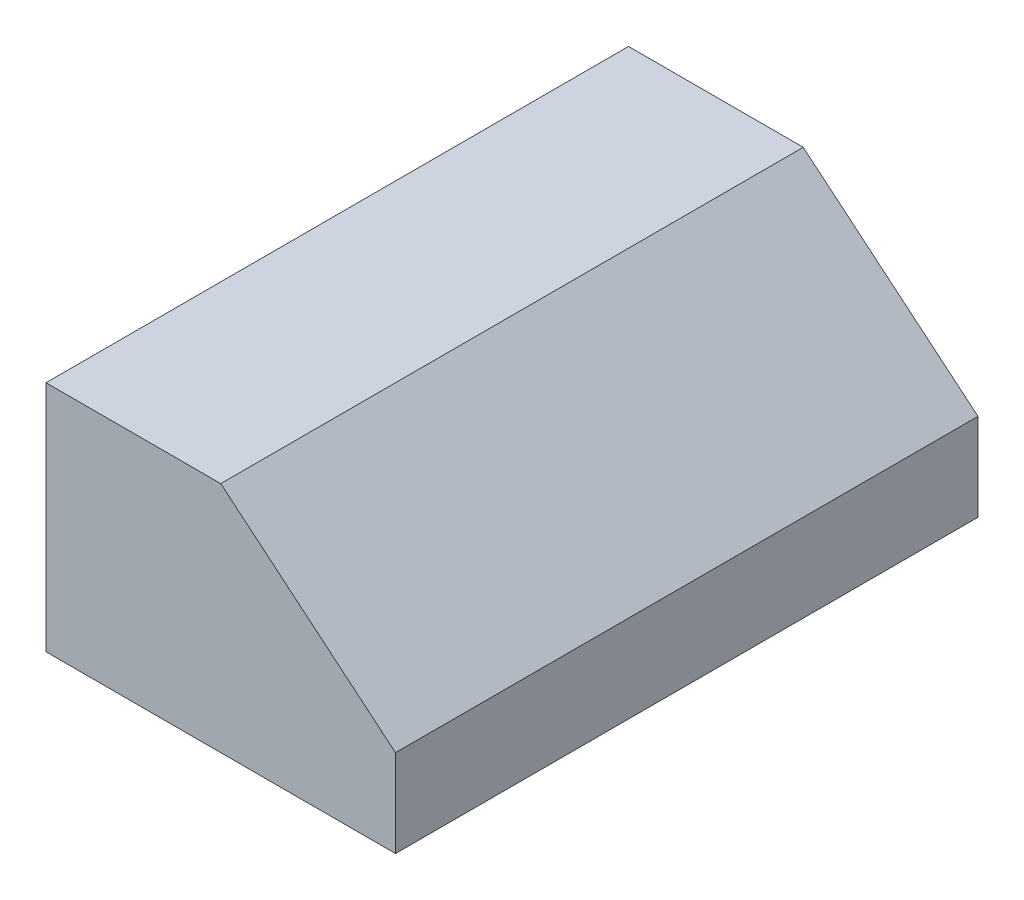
from build123d import *

# Parameters (mm, degrees)
SKETCH1_W          = 76.2
SKETCH1_H          = 50.8
EXTRUDE1_DEPTH     = 127
CUT_EXTRUDE1_DEPTH = 127


with BuildPart() as part:
    # Sketch1 → Extrude1 (new body)
    with BuildSketch(Plane.XY):
        with Locations((38.1, 25.4)):
            Rectangle(SKETCH1_W, SKETCH1_H)
    extrude(amount=EXTRUDE1_DEPTH)

    # Sketch2 → Cut-Extrude1 (cut)
    with BuildSketch(Plane.XY.offset(127)):
        Polygon((38.1, 50.8), (76.2, 50.8), (76.2, 19.05), align=None)
    extrude(amount=-CUT_EXTRUDE1_DEPTH, mode=Mode.SUBTRACT)


solid = part.part
